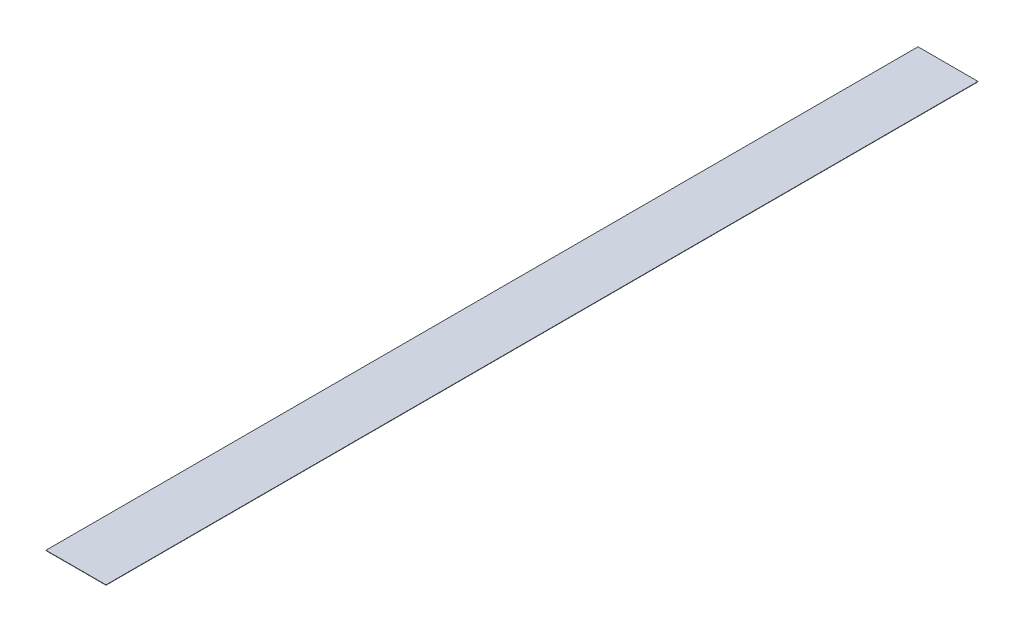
from build123d import *

# Parameters (mm, degrees)
SKETCH1_W           = 47.625
SKETCH1_H           = 692.15
BOSS_EXTRUDE1_DEPTH = 0.254


with BuildPart() as part:
    # Sketch1 → Boss-Extrude1 (new body)
    with BuildSketch(Plane(origin=(0, 0, 0), x_dir=(1, 0, 0), z_dir=(0, 1, 0))):
        with Locations((-23.8125, -346.075)):
            Rectangle(SKETCH1_W, SKETCH1_H)
    extrude(amount=BOSS_EXTRUDE1_DEPTH)


solid = part.part
